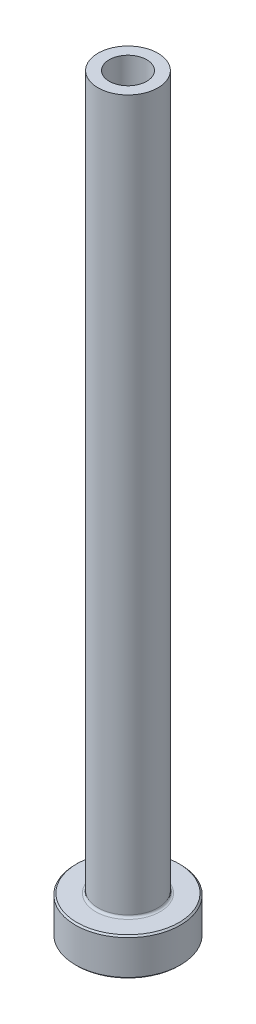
from build123d import *

# Parameters (mm, degrees)
FILLET1_R     = 0.3
CHAMFER1_SIZE = 0.2
CHAMFER3_SIZE = 0.5


with BuildPart() as part:
    # Sketch1 → Revolve1 (revolve)
    with BuildSketch(Plane.XY, mode=Mode.PRIVATE) as revolve1_sk:
        Polygon((-2.5, 100), (-4, 100), (-4, 5), (-7, 5), (-7, 0), (-2.75, 0), (-2.75, 43), (-2.5, 55), align=None)
    revolve(revolve1_sk.sketch.rotate(Axis((0, 92.187680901, 0), (0, -1, 0)), 270), axis=Axis((0, 92.187680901, 0), (0, -1, 0)))

    # Fillet1
    fillet1_edges = [part.edges().sort_by_distance(p)[0] for p in [
        (0, 5, -4),
    ]]
    fillet(fillet1_edges, radius=FILLET1_R)

    # Chamfer1
    chamfer1_edges = [part.edges().sort_by_distance(p)[0] for p in [
        (0, 0, -7),
        (0, 5, -7),
    ]]
    chamfer(chamfer1_edges, length=CHAMFER1_SIZE)

    # Chamfer3
    chamfer3_edges = [part.edges().sort_by_distance(p)[0] for p in [
        (0, 0, -2.75),
    ]]
    chamfer(chamfer3_edges, length=CHAMFER3_SIZE)


solid = part.part
